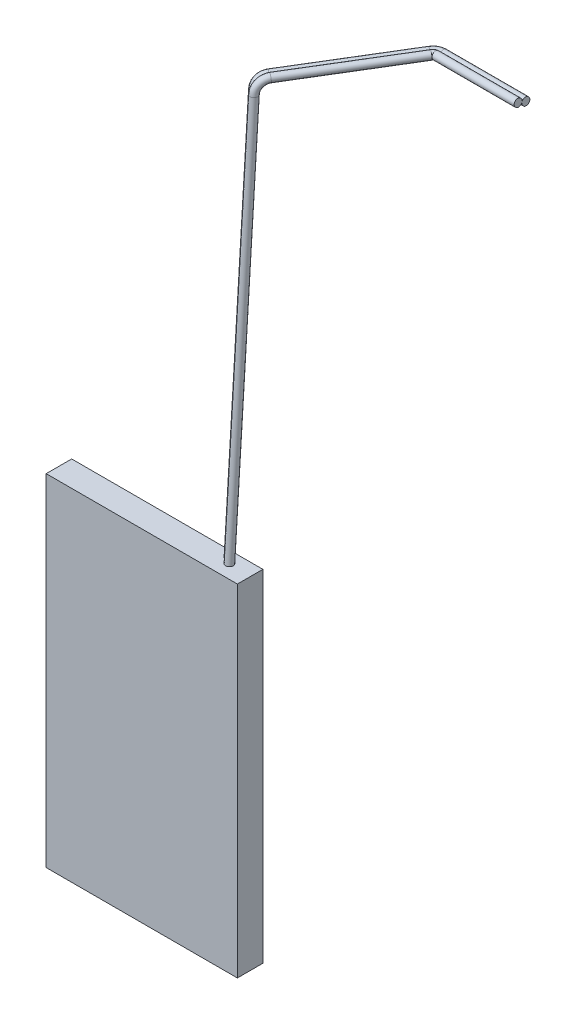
from build123d import *

# Parameters (mm, degrees)
SKETCH1_W           = 45
SKETCH1_H           = 80.3
BOSS_EXTRUDE1_DEPTH = 3


with BuildPart() as part:
    # Sketch1 → Boss-Extrude1 (new, symmetric)
    with BuildSketch(Plane.XY):
        Rectangle(SKETCH1_W, SKETCH1_H)
    extrude(amount=BOSS_EXTRUDE1_DEPTH, both=True)

    # Sweep1: sweep along a curve in space
    with BuildLine() as sweep1_path:
        Line((16.15, 40.15, -1.476), (14.844754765, 131.561952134, -8.55088173))
        ThreePointArc((14.844754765, 131.561952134, -8.55088173), (15.180705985, 133.258816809, -9.274633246), (16.055084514, 133.95, -10.782531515))
        Line((16.055084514, 133.95, -10.782531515), (30.361062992, 133.95, -34.312892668))
        ThreePointArc((30.361062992, 133.95, -34.312892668), (31.286429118, 133.95, -35.207318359), (32.5314173, 133.95, -35.533361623))
        Line((32.5314173, 133.95, -35.533361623), (51.860504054, 133.95, -35.533361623))
    # Sketch2 → Sweep1 (sweep)
    with BuildSketch(Plane(origin=(0, 40.15, 0), x_dir=(1, 0, 0), z_dir=(0, 1, 0))):
        with BuildLine():
            Line((16.861972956, 0.943632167), (16.874868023, 0.930737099))
            ThreePointArc((16.874868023, 0.930737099), (18.035853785, -0.409853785), (16.695262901, 0.751131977))
            Line((16.695262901, 0.751131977), (16.682367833, 0.764027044))
            ThreePointArc((16.682367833, 0.764027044), (15.521382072, 2.104617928), (16.861972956, 0.943632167))
        make_face()
    sweep(path=sweep1_path.line)


solid = part.part
